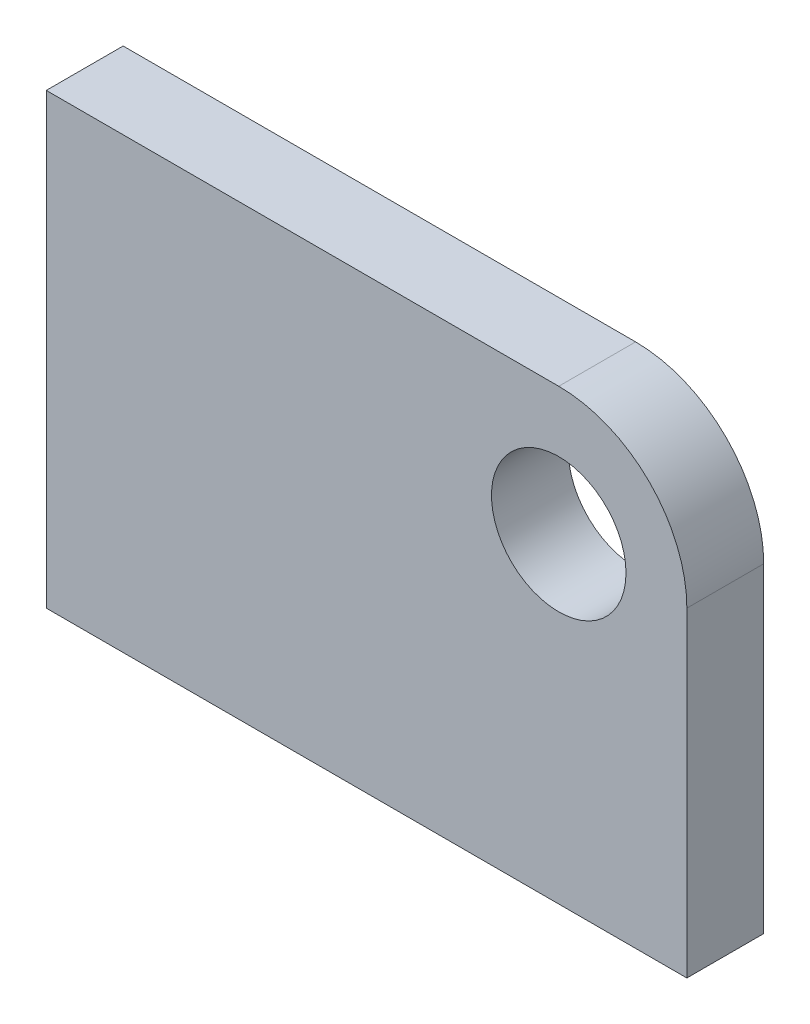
from build123d import *

# Parameters (mm, degrees)
ESQUISSE1_R          = 10.5
BASE_EXTRUSION_DEPTH = 12


with BuildPart() as part:
    # Esquisse1 → Base-Extrusion (new body)
    with BuildSketch(Plane.XY):
        with BuildLine():
            Line((0, 0), (80, 0))
            ThreePointArc((80, 0), (94.142135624, -5.857864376), (100, -20))
            Line((100, -20), (100, -70))
            Line((100, -70), (0, -70))
            Line((0, -70), (0, 0))
        make_face()
        with Locations((80, -20)):
            Circle(ESQUISSE1_R, mode=Mode.SUBTRACT)
    extrude(amount=BASE_EXTRUSION_DEPTH)


solid = part.part
